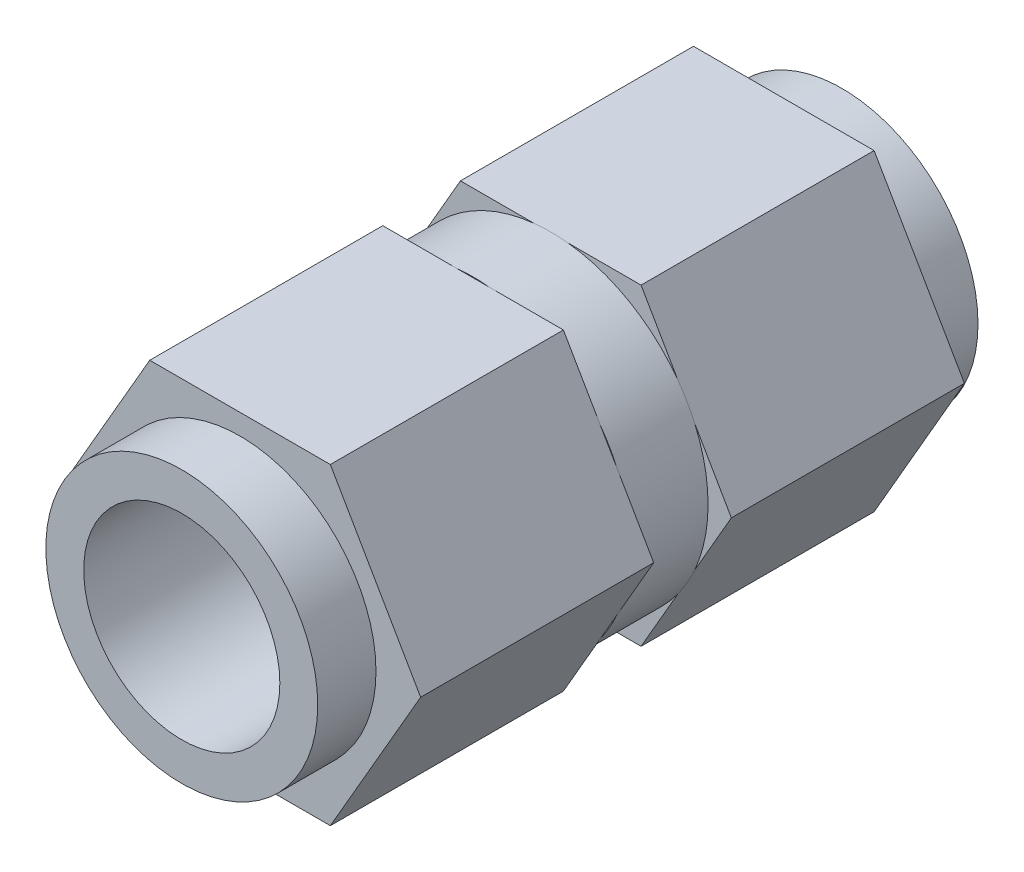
ISO-10303-21;
HEADER;
FILE_DESCRIPTION(('STEP AP214'),'2;1');
FILE_NAME('part.step','',(''),(''),'','','');
FILE_SCHEMA(('AUTOMOTIVE_DESIGN { 1 0 10303 214 1 1 1 1 }'));
ENDSEC;
DATA;
#1=APPLICATION_CONTEXT('core data for automotive mechanical design processes');
#2=APPLICATION_PROTOCOL_DEFINITION('international standard','automotive_design',2000,#1);
#3=PRODUCT_CONTEXT('',#1,'mechanical');
#4=PRODUCT('Part','Part','',(#3));
#5=PRODUCT_RELATED_PRODUCT_CATEGORY('part','',(#4));
#6=PRODUCT_DEFINITION_FORMATION('','',#4);
#7=PRODUCT_DEFINITION_CONTEXT('part definition',#1,'design');
#8=PRODUCT_DEFINITION('design','',#6,#7);
#9=PRODUCT_DEFINITION_SHAPE('','',#8);
#10=(LENGTH_UNIT() NAMED_UNIT(*) SI_UNIT(.MILLI.,.METRE.));
#11=(NAMED_UNIT(*) PLANE_ANGLE_UNIT() SI_UNIT($,.RADIAN.));
#12=(NAMED_UNIT(*) SI_UNIT($,.STERADIAN.) SOLID_ANGLE_UNIT());
#13=UNCERTAINTY_MEASURE_WITH_UNIT(LENGTH_MEASURE(1.E-05),#10,'distance_accuracy_value','');
#14=(GEOMETRIC_REPRESENTATION_CONTEXT(3) GLOBAL_UNCERTAINTY_ASSIGNED_CONTEXT((#13)) GLOBAL_UNIT_ASSIGNED_CONTEXT((#10,
#11,#12)) REPRESENTATION_CONTEXT('',''));
#15=CARTESIAN_POINT('',(0.,0.,0.));
#16=DIRECTION('',(0.,0.,1.));
#17=DIRECTION('',(1.,0.,0.));
#18=AXIS2_PLACEMENT_3D('',#15,#16,#17);
#19=CARTESIAN_POINT('',(0.,0.,1.));
#20=DIRECTION('',(0.,0.,-1.));
#21=DIRECTION('',(-1.,0.,0.));
#22=AXIS2_PLACEMENT_3D('',#19,#20,#21);
#23=CYLINDRICAL_SURFACE('',#22,0.75);
#24=CARTESIAN_POINT('',(0.,0.,-0.5));
#25=DIRECTION('',(0.,0.,-1.));
#26=DIRECTION('',(-1.,0.,0.));
#27=AXIS2_PLACEMENT_3D('',#24,#25,#26);
#28=CIRCLE('',#27,0.75);
#29=CARTESIAN_POINT('',(-0.75,0.,-0.5));
#30=VERTEX_POINT('',#29);
#31=EDGE_CURVE('E1018',#30,#30,#28,.T.);
#32=ORIENTED_EDGE('',*,*,#31,.T.);
#33=EDGE_LOOP('',(#32));
#34=FACE_BOUND('',#33,.T.);
#35=CARTESIAN_POINT('',(0.,0.,0.5));
#36=DIRECTION('',(0.,0.,1.));
#37=DIRECTION('',(1.,0.,0.));
#38=AXIS2_PLACEMENT_3D('',#35,#36,#37);
#39=CIRCLE('',#38,0.75);
#40=CARTESIAN_POINT('',(0.75,0.,0.5));
#41=VERTEX_POINT('',#40);
#42=EDGE_CURVE('E40',#41,#41,#39,.F.);
#43=ORIENTED_EDGE('',*,*,#42,.F.);
#44=EDGE_LOOP('',(#43));
#45=FACE_BOUND('',#44,.T.);
#46=ADVANCED_FACE('F36',(#34,#45),#23,.F.);
#47=CARTESIAN_POINT('',(0.,0.,14.));
#48=DIRECTION('',(0.,0.,1.));
#49=DIRECTION('',(1.,0.,0.));
#50=AXIS2_PLACEMENT_3D('',#47,#48,#49);
#51=PLANE('',#50);
#52=DIRECTION('',(0.499999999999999,0.866025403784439,0.));
#53=VECTOR('',#52,1.);
#54=CARTESIAN_POINT('',(2.325,-4.02701812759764,14.));
#55=LINE('',#54,#53);
#56=CARTESIAN_POINT('',(2.325,-4.02701812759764,14.));
#57=VERTEX_POINT('',#56);
#58=CARTESIAN_POINT('',(4.65,0.,14.));
#59=VERTEX_POINT('',#58);
#60=EDGE_CURVE('E211',#57,#59,#55,.T.);
#61=ORIENTED_EDGE('',*,*,#60,.T.);
#62=DIRECTION('',(-0.5,0.866025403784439,0.));
#63=VECTOR('',#62,1.);
#64=CARTESIAN_POINT('',(4.65,0.,14.));
#65=LINE('',#64,#63);
#66=CARTESIAN_POINT('',(2.325,4.02701812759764,14.));
#67=VERTEX_POINT('',#66);
#68=EDGE_CURVE('E199',#59,#67,#65,.T.);
#69=ORIENTED_EDGE('',*,*,#68,.T.);
#70=DIRECTION('',(-1.,0.,0.));
#71=VECTOR('',#70,1.);
#72=CARTESIAN_POINT('',(2.325,4.02701812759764,14.));
#73=LINE('',#72,#71);
#74=CARTESIAN_POINT('',(-2.325,4.02701812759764,14.));
#75=VERTEX_POINT('',#74);
#76=EDGE_CURVE('E210',#67,#75,#73,.T.);
#77=ORIENTED_EDGE('',*,*,#76,.T.);
#78=DIRECTION('',(-0.5,-0.866025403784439,0.));
#79=VECTOR('',#78,1.);
#80=CARTESIAN_POINT('',(-2.325,4.02701812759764,14.));
#81=LINE('',#80,#79);
#82=CARTESIAN_POINT('',(-4.65,0.,14.));
#83=VERTEX_POINT('',#82);
#84=EDGE_CURVE('E588',#75,#83,#81,.T.);
#85=ORIENTED_EDGE('',*,*,#84,.T.);
#86=DIRECTION('',(0.5,-0.866025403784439,0.));
#87=VECTOR('',#86,1.);
#88=CARTESIAN_POINT('',(-4.65,0.,14.));
#89=LINE('',#88,#87);
#90=CARTESIAN_POINT('',(-2.325,-4.02701812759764,14.));
#91=VERTEX_POINT('',#90);
#92=EDGE_CURVE('E1022',#83,#91,#89,.T.);
#93=ORIENTED_EDGE('',*,*,#92,.T.);
#94=DIRECTION('',(1.,0.,0.));
#95=VECTOR('',#94,1.);
#96=CARTESIAN_POINT('',(-2.325,-4.02701812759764,14.));
#97=LINE('',#96,#95);
#98=EDGE_CURVE('E217',#91,#57,#97,.T.);
#99=ORIENTED_EDGE('',*,*,#98,.T.);
#100=EDGE_LOOP('',(#61,#69,#77,#85,#93,#99));
#101=FACE_BOUND('',#100,.T.);
#102=CARTESIAN_POINT('',(0.,0.,14.));
#103=DIRECTION('',(0.,0.,1.));
#104=DIRECTION('',(1.,0.,0.));
#105=AXIS2_PLACEMENT_3D('',#102,#103,#104);
#106=CIRCLE('',#105,3.5);
#107=CARTESIAN_POINT('',(3.5,0.,14.));
#108=VERTEX_POINT('',#107);
#109=EDGE_CURVE('E1019',#108,#108,#106,.T.);
#110=ORIENTED_EDGE('',*,*,#109,.F.);
#111=EDGE_LOOP('',(#110));
#112=FACE_BOUND('',#111,.T.);
#113=ADVANCED_FACE('F214',(#101,#112),#51,.T.);
#114=CARTESIAN_POINT('',(0.,0.,0.));
#115=DIRECTION('',(0.,0.,1.));
#116=DIRECTION('',(1.,0.,0.));
#117=AXIS2_PLACEMENT_3D('',#114,#115,#116);
#118=PLANE('',#117);
#119=DIRECTION('',(0.499999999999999,0.866025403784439,0.));
#120=VECTOR('',#119,1.);
#121=CARTESIAN_POINT('',(2.325,-4.02701812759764,0.));
#122=LINE('',#121,#120);
#123=CARTESIAN_POINT('',(2.325,-4.02701812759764,0.));
#124=VERTEX_POINT('',#123);
#125=CARTESIAN_POINT('',(4.65,0.,0.));
#126=VERTEX_POINT('',#125);
#127=EDGE_CURVE('E246',#124,#126,#122,.T.);
#128=ORIENTED_EDGE('',*,*,#127,.F.);
#129=DIRECTION('',(1.,0.,0.));
#130=VECTOR('',#129,1.);
#131=CARTESIAN_POINT('',(-2.325,-4.02701812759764,0.));
#132=LINE('',#131,#130);
#133=CARTESIAN_POINT('',(-2.325,-4.02701812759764,0.));
#134=VERTEX_POINT('',#133);
#135=EDGE_CURVE('E303',#134,#124,#132,.T.);
#136=ORIENTED_EDGE('',*,*,#135,.F.);
#137=DIRECTION('',(0.5,-0.866025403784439,0.));
#138=VECTOR('',#137,1.);
#139=CARTESIAN_POINT('',(-4.65,0.,0.));
#140=LINE('',#139,#138);
#141=CARTESIAN_POINT('',(-4.65,0.,0.));
#142=VERTEX_POINT('',#141);
#143=EDGE_CURVE('E300',#142,#134,#140,.T.);
#144=ORIENTED_EDGE('',*,*,#143,.F.);
#145=DIRECTION('',(-0.5,-0.866025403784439,0.));
#146=VECTOR('',#145,1.);
#147=CARTESIAN_POINT('',(-2.325,4.02701812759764,0.));
#148=LINE('',#147,#146);
#149=CARTESIAN_POINT('',(-2.325,4.02701812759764,0.));
#150=VERTEX_POINT('',#149);
#151=EDGE_CURVE('E297',#150,#142,#148,.T.);
#152=ORIENTED_EDGE('',*,*,#151,.F.);
#153=DIRECTION('',(-1.,0.,0.));
#154=VECTOR('',#153,1.);
#155=CARTESIAN_POINT('',(2.325,4.02701812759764,0.));
#156=LINE('',#155,#154);
#157=CARTESIAN_POINT('',(2.325,4.02701812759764,0.));
#158=VERTEX_POINT('',#157);
#159=EDGE_CURVE('E294',#158,#150,#156,.T.);
#160=ORIENTED_EDGE('',*,*,#159,.F.);
#161=DIRECTION('',(-0.5,0.866025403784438,0.));
#162=VECTOR('',#161,1.);
#163=CARTESIAN_POINT('',(4.65,0.,0.));
#164=LINE('',#163,#162);
#165=EDGE_CURVE('E291',#126,#158,#164,.T.);
#166=ORIENTED_EDGE('',*,*,#165,.F.);
#167=EDGE_LOOP('',(#128,#136,#144,#152,#160,#166));
#168=FACE_BOUND('',#167,.T.);
#169=CARTESIAN_POINT('',(0.,0.,0.));
#170=DIRECTION('',(0.,0.,1.));
#171=DIRECTION('',(1.,0.,0.));
#172=AXIS2_PLACEMENT_3D('',#169,#170,#171);
#173=CIRCLE('',#172,3.5);
#174=CARTESIAN_POINT('',(3.5,0.,0.));
#175=VERTEX_POINT('',#174);
#176=EDGE_CURVE('E11',#175,#175,#173,.F.);
#177=ORIENTED_EDGE('',*,*,#176,.F.);
#178=EDGE_LOOP('',(#177));
#179=FACE_BOUND('',#178,.T.);
#180=ADVANCED_FACE('F420',(#168,#179),#118,.F.);
#181=CARTESIAN_POINT('',(0.,0.,8.));
#182=DIRECTION('',(0.,0.,1.));
#183=DIRECTION('',(1.,0.,0.));
#184=AXIS2_PLACEMENT_3D('',#181,#182,#183);
#185=PLANE('',#184);
#186=DIRECTION('',(0.499999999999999,0.866025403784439,0.));
#187=VECTOR('',#186,1.);
#188=CARTESIAN_POINT('',(2.325,-4.02701812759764,8.));
#189=LINE('',#188,#187);
#190=CARTESIAN_POINT('',(3.27207876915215,-2.38662958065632,8.));
#191=VERTEX_POINT('',#190);
#192=CARTESIAN_POINT('',(3.70292123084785,-1.64038854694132,8.));
#193=VERTEX_POINT('',#192);
#194=EDGE_CURVE('E46',#191,#193,#189,.T.);
#195=ORIENTED_EDGE('',*,*,#194,.F.);
#196=CARTESIAN_POINT('',(0.,0.,8.));
#197=DIRECTION('',(0.,0.,1.));
#198=DIRECTION('',(1.,0.,0.));
#199=AXIS2_PLACEMENT_3D('',#196,#197,#198);
#200=CIRCLE('',#199,4.050000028);
#201=EDGE_CURVE('E543',#191,#193,#200,.T.);
#202=ORIENTED_EDGE('',*,*,#201,.T.);
#203=EDGE_LOOP('',(#195,#202));
#204=FACE_BOUND('',#203,.T.);
#205=ADVANCED_FACE('F528',(#204),#185,.T.);
#206=DIRECTION('',(1.,0.,0.));
#207=VECTOR('',#206,1.);
#208=CARTESIAN_POINT('',(-2.325,-4.02701812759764,8.));
#209=LINE('',#208,#207);
#210=CARTESIAN_POINT('',(-0.430842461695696,-4.02701812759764,8.));
#211=VERTEX_POINT('',#210);
#212=CARTESIAN_POINT('',(0.430842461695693,-4.02701812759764,8.));
#213=VERTEX_POINT('',#212);
#214=EDGE_CURVE('E572',#211,#213,#209,.T.);
#215=ORIENTED_EDGE('',*,*,#214,.F.);
#216=EDGE_CURVE('E616',#211,#213,#200,.T.);
#217=ORIENTED_EDGE('',*,*,#216,.T.);
#218=EDGE_LOOP('',(#215,#217));
#219=FACE_BOUND('',#218,.T.);
#220=ADVANCED_FACE('F630',(#219),#185,.T.);
#221=DIRECTION('',(0.5,-0.866025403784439,0.));
#222=VECTOR('',#221,1.);
#223=CARTESIAN_POINT('',(-4.65,0.,8.));
#224=LINE('',#223,#222);
#225=CARTESIAN_POINT('',(-3.70292123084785,-1.64038854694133,8.));
#226=VERTEX_POINT('',#225);
#227=CARTESIAN_POINT('',(-3.27207876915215,-2.38662958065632,8.));
#228=VERTEX_POINT('',#227);
#229=EDGE_CURVE('E568',#226,#228,#224,.T.);
#230=ORIENTED_EDGE('',*,*,#229,.F.);
#231=EDGE_CURVE('E604',#226,#228,#200,.T.);
#232=ORIENTED_EDGE('',*,*,#231,.T.);
#233=EDGE_LOOP('',(#230,#232));
#234=FACE_BOUND('',#233,.T.);
#235=ADVANCED_FACE('F635',(#234),#185,.T.);
#236=DIRECTION('',(-0.5,-0.866025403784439,0.));
#237=VECTOR('',#236,1.);
#238=CARTESIAN_POINT('',(-2.325,4.02701812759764,8.));
#239=LINE('',#238,#237);
#240=CARTESIAN_POINT('',(-3.27207876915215,2.38662958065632,8.));
#241=VERTEX_POINT('',#240);
#242=CARTESIAN_POINT('',(-3.70292123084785,1.64038854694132,8.));
#243=VERTEX_POINT('',#242);
#244=EDGE_CURVE('E562',#241,#243,#239,.T.);
#245=ORIENTED_EDGE('',*,*,#244,.F.);
#246=EDGE_CURVE('E597',#241,#243,#200,.T.);
#247=ORIENTED_EDGE('',*,*,#246,.T.);
#248=EDGE_LOOP('',(#245,#247));
#249=FACE_BOUND('',#248,.T.);
#250=ADVANCED_FACE('F682',(#249),#185,.T.);
#251=DIRECTION('',(-1.,0.,0.));
#252=VECTOR('',#251,1.);
#253=CARTESIAN_POINT('',(2.325,4.02701812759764,8.));
#254=LINE('',#253,#252);
#255=CARTESIAN_POINT('',(0.430842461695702,4.02701812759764,8.));
#256=VERTEX_POINT('',#255);
#257=CARTESIAN_POINT('',(-0.430842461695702,4.02701812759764,8.));
#258=VERTEX_POINT('',#257);
#259=EDGE_CURVE('E365',#256,#258,#254,.T.);
#260=ORIENTED_EDGE('',*,*,#259,.F.);
#261=EDGE_CURVE('E596',#256,#258,#200,.T.);
#262=ORIENTED_EDGE('',*,*,#261,.T.);
#263=EDGE_LOOP('',(#260,#262));
#264=FACE_BOUND('',#263,.T.);
#265=ADVANCED_FACE('F529',(#264),#185,.T.);
#266=CARTESIAN_POINT('',(0.,0.,6.));
#267=DIRECTION('',(0.,0.,1.));
#268=DIRECTION('',(1.,0.,0.));
#269=AXIS2_PLACEMENT_3D('',#266,#267,#268);
#270=PLANE('',#269);
#271=CARTESIAN_POINT('',(0.,0.,6.));
#272=DIRECTION('',(0.,0.,1.));
#273=DIRECTION('',(1.,0.,0.));
#274=AXIS2_PLACEMENT_3D('',#271,#272,#273);
#275=CIRCLE('',#274,4.050000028);
#276=CARTESIAN_POINT('',(3.27207876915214,2.38662958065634,6.));
#277=VERTEX_POINT('',#276);
#278=CARTESIAN_POINT('',(0.430842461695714,4.02701812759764,6.));
#279=VERTEX_POINT('',#278);
#280=EDGE_CURVE('E357',#277,#279,#275,.T.);
#281=ORIENTED_EDGE('',*,*,#280,.F.);
#282=DIRECTION('',(-0.5,0.866025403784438,0.));
#283=VECTOR('',#282,1.);
#284=CARTESIAN_POINT('',(4.65,0.,6.));
#285=LINE('',#284,#283);
#286=CARTESIAN_POINT('',(2.325,4.02701812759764,6.));
#287=VERTEX_POINT('',#286);
#288=EDGE_CURVE('E256',#277,#287,#285,.T.);
#289=ORIENTED_EDGE('',*,*,#288,.T.);
#290=DIRECTION('',(-1.,0.,0.));
#291=VECTOR('',#290,1.);
#292=CARTESIAN_POINT('',(2.325,4.02701812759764,6.));
#293=LINE('',#292,#291);
#294=EDGE_CURVE('E264',#287,#279,#293,.T.);
#295=ORIENTED_EDGE('',*,*,#294,.T.);
#296=EDGE_LOOP('',(#281,#289,#295));
#297=FACE_BOUND('',#296,.T.);
#298=ADVANCED_FACE('F433',(#297),#270,.T.);
#299=CARTESIAN_POINT('',(-0.430842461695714,4.02701812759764,6.));
#300=VERTEX_POINT('',#299);
#301=CARTESIAN_POINT('',(-3.27207876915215,2.38662958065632,6.));
#302=VERTEX_POINT('',#301);
#303=EDGE_CURVE('E352',#300,#302,#275,.T.);
#304=ORIENTED_EDGE('',*,*,#303,.F.);
#305=CARTESIAN_POINT('',(-2.325,4.02701812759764,6.));
#306=VERTEX_POINT('',#305);
#307=EDGE_CURVE('E262',#300,#306,#293,.T.);
#308=ORIENTED_EDGE('',*,*,#307,.T.);
#309=DIRECTION('',(-0.5,-0.866025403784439,0.));
#310=VECTOR('',#309,1.);
#311=CARTESIAN_POINT('',(-2.325,4.02701812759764,6.));
#312=LINE('',#311,#310);
#313=EDGE_CURVE('E270',#306,#302,#312,.T.);
#314=ORIENTED_EDGE('',*,*,#313,.T.);
#315=EDGE_LOOP('',(#304,#308,#314));
#316=FACE_BOUND('',#315,.T.);
#317=ADVANCED_FACE('F439',(#316),#270,.T.);
#318=CARTESIAN_POINT('',(-3.70292123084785,1.64038854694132,6.));
#319=VERTEX_POINT('',#318);
#320=CARTESIAN_POINT('',(-3.70292123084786,-1.64038854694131,6.));
#321=VERTEX_POINT('',#320);
#322=EDGE_CURVE('E346',#319,#321,#275,.T.);
#323=ORIENTED_EDGE('',*,*,#322,.F.);
#324=CARTESIAN_POINT('',(-4.65,0.,6.));
#325=VERTEX_POINT('',#324);
#326=EDGE_CURVE('E268',#319,#325,#312,.T.);
#327=ORIENTED_EDGE('',*,*,#326,.T.);
#328=DIRECTION('',(0.5,-0.866025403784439,0.));
#329=VECTOR('',#328,1.);
#330=CARTESIAN_POINT('',(-4.65,0.,6.));
#331=LINE('',#330,#329);
#332=EDGE_CURVE('E276',#325,#321,#331,.T.);
#333=ORIENTED_EDGE('',*,*,#332,.T.);
#334=EDGE_LOOP('',(#323,#327,#333));
#335=FACE_BOUND('',#334,.T.);
#336=ADVANCED_FACE('F449',(#335),#270,.T.);
#337=CARTESIAN_POINT('',(-3.27207876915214,-2.38662958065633,6.));
#338=VERTEX_POINT('',#337);
#339=CARTESIAN_POINT('',(-0.430842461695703,-4.02701812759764,6.));
#340=VERTEX_POINT('',#339);
#341=EDGE_CURVE('E340',#338,#340,#275,.T.);
#342=ORIENTED_EDGE('',*,*,#341,.F.);
#343=CARTESIAN_POINT('',(-2.325,-4.02701812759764,6.));
#344=VERTEX_POINT('',#343);
#345=EDGE_CURVE('E274',#338,#344,#331,.T.);
#346=ORIENTED_EDGE('',*,*,#345,.T.);
#347=DIRECTION('',(1.,0.,0.));
#348=VECTOR('',#347,1.);
#349=CARTESIAN_POINT('',(-2.325,-4.02701812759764,6.));
#350=LINE('',#349,#348);
#351=EDGE_CURVE('E282',#344,#340,#350,.T.);
#352=ORIENTED_EDGE('',*,*,#351,.T.);
#353=EDGE_LOOP('',(#342,#346,#352));
#354=FACE_BOUND('',#353,.T.);
#355=ADVANCED_FACE('F460',(#354),#270,.T.);
#356=CARTESIAN_POINT('',(0.430842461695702,-4.02701812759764,6.));
#357=VERTEX_POINT('',#356);
#358=CARTESIAN_POINT('',(3.27207876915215,-2.38662958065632,6.));
#359=VERTEX_POINT('',#358);
#360=EDGE_CURVE('E334',#357,#359,#275,.T.);
#361=ORIENTED_EDGE('',*,*,#360,.F.);
#362=CARTESIAN_POINT('',(2.325,-4.02701812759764,6.));
#363=VERTEX_POINT('',#362);
#364=EDGE_CURVE('E280',#357,#363,#350,.T.);
#365=ORIENTED_EDGE('',*,*,#364,.T.);
#366=DIRECTION('',(0.499999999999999,0.866025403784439,0.));
#367=VECTOR('',#366,1.);
#368=CARTESIAN_POINT('',(2.325,-4.02701812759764,6.));
#369=LINE('',#368,#367);
#370=EDGE_CURVE('E252',#363,#359,#369,.T.);
#371=ORIENTED_EDGE('',*,*,#370,.T.);
#372=EDGE_LOOP('',(#361,#365,#371));
#373=FACE_BOUND('',#372,.T.);
#374=ADVANCED_FACE('F397',(#373),#270,.T.);
#375=CARTESIAN_POINT('',(2.325,-4.02701812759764,6.));
#376=DIRECTION('',(-0.866025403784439,0.499999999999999,0.));
#377=DIRECTION('',(-0.499999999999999,-0.866025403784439,0.));
#378=AXIS2_PLACEMENT_3D('',#375,#376,#377);
#379=PLANE('',#378);
#380=ORIENTED_EDGE('',*,*,#127,.T.);
#381=DIRECTION('',(0.,0.,-1.));
#382=VECTOR('',#381,1.);
#383=CARTESIAN_POINT('',(4.65,0.,6.));
#384=LINE('',#383,#382);
#385=CARTESIAN_POINT('',(4.65,0.,6.));
#386=VERTEX_POINT('',#385);
#387=EDGE_CURVE('E324',#386,#126,#384,.T.);
#388=ORIENTED_EDGE('',*,*,#387,.F.);
#389=CARTESIAN_POINT('',(3.70292123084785,-1.64038854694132,6.));
#390=VERTEX_POINT('',#389);
#391=EDGE_CURVE('E258',#390,#386,#369,.T.);
#392=ORIENTED_EDGE('',*,*,#391,.F.);
#393=EDGE_CURVE('E257',#359,#390,#369,.T.);
#394=ORIENTED_EDGE('',*,*,#393,.F.);
#395=ORIENTED_EDGE('',*,*,#370,.F.);
#396=DIRECTION('',(0.,0.,-1.));
#397=VECTOR('',#396,1.);
#398=CARTESIAN_POINT('',(2.325,-4.02701812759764,6.));
#399=LINE('',#398,#397);
#400=EDGE_CURVE('E286',#363,#124,#399,.T.);
#401=ORIENTED_EDGE('',*,*,#400,.T.);
#402=EDGE_LOOP('',(#380,#388,#392,#394,#395,#401));
#403=FACE_BOUND('',#402,.T.);
#404=ADVANCED_FACE('F38',(#403),#379,.F.);
#405=CARTESIAN_POINT('',(4.65,0.,6.));
#406=DIRECTION('',(-0.866025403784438,-0.5,0.));
#407=DIRECTION('',(0.5,-0.866025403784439,0.));
#408=AXIS2_PLACEMENT_3D('',#405,#406,#407);
#409=PLANE('',#408);
#410=ORIENTED_EDGE('',*,*,#165,.T.);
#411=DIRECTION('',(0.,0.,-1.));
#412=VECTOR('',#411,1.);
#413=CARTESIAN_POINT('',(2.325,4.02701812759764,6.));
#414=LINE('',#413,#412);
#415=EDGE_CURVE('E320',#287,#158,#414,.T.);
#416=ORIENTED_EDGE('',*,*,#415,.F.);
#417=ORIENTED_EDGE('',*,*,#288,.F.);
#418=CARTESIAN_POINT('',(3.70292123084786,1.6403885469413,6.));
#419=VERTEX_POINT('',#418);
#420=EDGE_CURVE('E263',#419,#277,#285,.T.);
#421=ORIENTED_EDGE('',*,*,#420,.F.);
#422=EDGE_CURVE('E259',#386,#419,#285,.T.);
#423=ORIENTED_EDGE('',*,*,#422,.F.);
#424=ORIENTED_EDGE('',*,*,#387,.T.);
#425=EDGE_LOOP('',(#410,#416,#417,#421,#423,#424));
#426=FACE_BOUND('',#425,.T.);
#427=ADVANCED_FACE('F416',(#426),#409,.F.);
#428=CARTESIAN_POINT('',(2.325,4.02701812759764,6.));
#429=DIRECTION('',(0.,-1.,0.));
#430=DIRECTION('',(0.,0.,-1.));
#431=AXIS2_PLACEMENT_3D('',#428,#429,#430);
#432=PLANE('',#431);
#433=ORIENTED_EDGE('',*,*,#159,.T.);
#434=DIRECTION('',(0.,0.,-1.));
#435=VECTOR('',#434,1.);
#436=CARTESIAN_POINT('',(-2.325,4.02701812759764,6.));
#437=LINE('',#436,#435);
#438=EDGE_CURVE('E316',#306,#150,#437,.T.);
#439=ORIENTED_EDGE('',*,*,#438,.F.);
#440=ORIENTED_EDGE('',*,*,#307,.F.);
#441=EDGE_CURVE('E269',#279,#300,#293,.T.);
#442=ORIENTED_EDGE('',*,*,#441,.F.);
#443=ORIENTED_EDGE('',*,*,#294,.F.);
#444=ORIENTED_EDGE('',*,*,#415,.T.);
#445=EDGE_LOOP('',(#433,#439,#440,#442,#443,#444));
#446=FACE_BOUND('',#445,.T.);
#447=ADVANCED_FACE('F428',(#446),#432,.F.);
#448=CARTESIAN_POINT('',(-2.325,4.02701812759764,6.));
#449=DIRECTION('',(0.866025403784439,-0.5,0.));
#450=DIRECTION('',(0.5,0.866025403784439,0.));
#451=AXIS2_PLACEMENT_3D('',#448,#449,#450);
#452=PLANE('',#451);
#453=ORIENTED_EDGE('',*,*,#151,.T.);
#454=DIRECTION('',(0.,0.,-1.));
#455=VECTOR('',#454,1.);
#456=CARTESIAN_POINT('',(-4.65,0.,6.));
#457=LINE('',#456,#455);
#458=EDGE_CURVE('E312',#325,#142,#457,.T.);
#459=ORIENTED_EDGE('',*,*,#458,.F.);
#460=ORIENTED_EDGE('',*,*,#326,.F.);
#461=EDGE_CURVE('E275',#302,#319,#312,.T.);
#462=ORIENTED_EDGE('',*,*,#461,.F.);
#463=ORIENTED_EDGE('',*,*,#313,.F.);
#464=ORIENTED_EDGE('',*,*,#438,.T.);
#465=EDGE_LOOP('',(#453,#459,#460,#462,#463,#464));
#466=FACE_BOUND('',#465,.T.);
#467=ADVANCED_FACE('F442',(#466),#452,.F.);
#468=CARTESIAN_POINT('',(-4.65,0.,6.));
#469=DIRECTION('',(0.866025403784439,0.5,0.));
#470=DIRECTION('',(-0.5,0.866025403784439,0.));
#471=AXIS2_PLACEMENT_3D('',#468,#469,#470);
#472=PLANE('',#471);
#473=ORIENTED_EDGE('',*,*,#143,.T.);
#474=DIRECTION('',(0.,0.,-1.));
#475=VECTOR('',#474,1.);
#476=CARTESIAN_POINT('',(-2.325,-4.02701812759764,6.));
#477=LINE('',#476,#475);
#478=EDGE_CURVE('E308',#344,#134,#477,.T.);
#479=ORIENTED_EDGE('',*,*,#478,.F.);
#480=ORIENTED_EDGE('',*,*,#345,.F.);
#481=EDGE_CURVE('E281',#321,#338,#331,.T.);
#482=ORIENTED_EDGE('',*,*,#481,.F.);
#483=ORIENTED_EDGE('',*,*,#332,.F.);
#484=ORIENTED_EDGE('',*,*,#458,.T.);
#485=EDGE_LOOP('',(#473,#479,#480,#482,#483,#484));
#486=FACE_BOUND('',#485,.T.);
#487=ADVANCED_FACE('F452',(#486),#472,.F.);
#488=CARTESIAN_POINT('',(-2.325,-4.02701812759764,6.));
#489=DIRECTION('',(0.,1.,0.));
#490=DIRECTION('',(-1.,0.,0.));
#491=AXIS2_PLACEMENT_3D('',#488,#489,#490);
#492=PLANE('',#491);
#493=ORIENTED_EDGE('',*,*,#135,.T.);
#494=ORIENTED_EDGE('',*,*,#400,.F.);
#495=ORIENTED_EDGE('',*,*,#364,.F.);
#496=EDGE_CURVE('E287',#340,#357,#350,.T.);
#497=ORIENTED_EDGE('',*,*,#496,.F.);
#498=ORIENTED_EDGE('',*,*,#351,.F.);
#499=ORIENTED_EDGE('',*,*,#478,.T.);
#500=EDGE_LOOP('',(#493,#494,#495,#497,#498,#499));
#501=FACE_BOUND('',#500,.T.);
#502=ADVANCED_FACE('F400',(#501),#492,.F.);
#503=EDGE_CURVE('E251',#390,#419,#275,.T.);
#504=ORIENTED_EDGE('',*,*,#503,.F.);
#505=ORIENTED_EDGE('',*,*,#391,.T.);
#506=ORIENTED_EDGE('',*,*,#422,.T.);
#507=EDGE_LOOP('',(#504,#505,#506));
#508=FACE_BOUND('',#507,.T.);
#509=ADVANCED_FACE('F414',(#508),#270,.T.);
#510=CARTESIAN_POINT('',(0.,0.,6.));
#511=DIRECTION('',(0.,0.,1.));
#512=DIRECTION('',(1.,0.,0.));
#513=AXIS2_PLACEMENT_3D('',#510,#511,#512);
#514=PLANE('',#513);
#515=EDGE_CURVE('E230',#359,#390,#275,.T.);
#516=ORIENTED_EDGE('',*,*,#515,.F.);
#517=ORIENTED_EDGE('',*,*,#393,.T.);
#518=EDGE_LOOP('',(#516,#517));
#519=FACE_BOUND('',#518,.T.);
#520=ADVANCED_FACE('F530',(#519),#514,.F.);
#521=EDGE_CURVE('E238',#419,#277,#275,.T.);
#522=ORIENTED_EDGE('',*,*,#521,.F.);
#523=ORIENTED_EDGE('',*,*,#420,.T.);
#524=EDGE_LOOP('',(#522,#523));
#525=FACE_BOUND('',#524,.T.);
#526=ADVANCED_FACE('F532',(#525),#514,.F.);
#527=EDGE_CURVE('E250',#279,#300,#275,.T.);
#528=ORIENTED_EDGE('',*,*,#527,.F.);
#529=ORIENTED_EDGE('',*,*,#441,.T.);
#530=EDGE_LOOP('',(#528,#529));
#531=FACE_BOUND('',#530,.T.);
#532=ADVANCED_FACE('F435',(#531),#514,.F.);
#533=EDGE_CURVE('E370',#302,#319,#275,.T.);
#534=ORIENTED_EDGE('',*,*,#533,.F.);
#535=ORIENTED_EDGE('',*,*,#461,.T.);
#536=EDGE_LOOP('',(#534,#535));
#537=FACE_BOUND('',#536,.T.);
#538=ADVANCED_FACE('F831',(#537),#514,.F.);
#539=EDGE_CURVE('E374',#321,#338,#275,.T.);
#540=ORIENTED_EDGE('',*,*,#539,.F.);
#541=ORIENTED_EDGE('',*,*,#481,.T.);
#542=EDGE_LOOP('',(#540,#541));
#543=FACE_BOUND('',#542,.T.);
#544=ADVANCED_FACE('F537',(#543),#514,.F.);
#545=EDGE_CURVE('E236',#340,#357,#275,.T.);
#546=ORIENTED_EDGE('',*,*,#545,.F.);
#547=ORIENTED_EDGE('',*,*,#496,.T.);
#548=EDGE_LOOP('',(#546,#547));
#549=FACE_BOUND('',#548,.T.);
#550=ADVANCED_FACE('F386',(#549),#514,.F.);
#551=CARTESIAN_POINT('',(0.,0.,8.));
#552=DIRECTION('',(0.,0.,-1.));
#553=DIRECTION('',(-1.,0.,0.));
#554=AXIS2_PLACEMENT_3D('',#551,#552,#553);
#555=CYLINDRICAL_SURFACE('',#554,4.050000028);
#556=CARTESIAN_POINT('',(3.70292123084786,1.6403885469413,8.));
#557=VERTEX_POINT('',#556);
#558=CARTESIAN_POINT('',(3.27207876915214,2.38662958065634,8.));
#559=VERTEX_POINT('',#558);
#560=EDGE_CURVE('E244',#557,#559,#200,.T.);
#561=ORIENTED_EDGE('',*,*,#560,.F.);
#562=EDGE_CURVE('E53',#193,#557,#200,.T.);
#563=ORIENTED_EDGE('',*,*,#562,.F.);
#564=ORIENTED_EDGE('',*,*,#201,.F.);
#565=EDGE_CURVE('E621',#213,#191,#200,.T.);
#566=ORIENTED_EDGE('',*,*,#565,.F.);
#567=ORIENTED_EDGE('',*,*,#216,.F.);
#568=EDGE_CURVE('E610',#228,#211,#200,.T.);
#569=ORIENTED_EDGE('',*,*,#568,.F.);
#570=ORIENTED_EDGE('',*,*,#231,.F.);
#571=EDGE_CURVE('E600',#243,#226,#200,.T.);
#572=ORIENTED_EDGE('',*,*,#571,.F.);
#573=ORIENTED_EDGE('',*,*,#246,.F.);
#574=EDGE_CURVE('E593',#258,#241,#200,.T.);
#575=ORIENTED_EDGE('',*,*,#574,.F.);
#576=ORIENTED_EDGE('',*,*,#261,.F.);
#577=EDGE_CURVE('E247',#559,#256,#200,.T.);
#578=ORIENTED_EDGE('',*,*,#577,.F.);
#579=EDGE_LOOP('',(#561,#563,#564,#566,#567,#569,#570,#572,#573,#575,#576,#578));
#580=FACE_BOUND('',#579,.T.);
#581=ORIENTED_EDGE('',*,*,#521,.T.);
#582=ORIENTED_EDGE('',*,*,#280,.T.);
#583=ORIENTED_EDGE('',*,*,#527,.T.);
#584=ORIENTED_EDGE('',*,*,#303,.T.);
#585=ORIENTED_EDGE('',*,*,#533,.T.);
#586=ORIENTED_EDGE('',*,*,#322,.T.);
#587=ORIENTED_EDGE('',*,*,#539,.T.);
#588=ORIENTED_EDGE('',*,*,#341,.T.);
#589=ORIENTED_EDGE('',*,*,#545,.T.);
#590=ORIENTED_EDGE('',*,*,#360,.T.);
#591=ORIENTED_EDGE('',*,*,#515,.T.);
#592=ORIENTED_EDGE('',*,*,#503,.T.);
#593=EDGE_LOOP('',(#581,#582,#583,#584,#585,#586,#587,#588,#589,#590,#591,#592));
#594=FACE_BOUND('',#593,.T.);
#595=ADVANCED_FACE('F383',(#580,#594),#555,.T.);
#596=DIRECTION('',(-0.5,0.866025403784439,0.));
#597=VECTOR('',#596,1.);
#598=CARTESIAN_POINT('',(4.65,0.,8.));
#599=LINE('',#598,#597);
#600=EDGE_CURVE('E361',#557,#559,#599,.T.);
#601=ORIENTED_EDGE('',*,*,#600,.F.);
#602=ORIENTED_EDGE('',*,*,#560,.T.);
#603=EDGE_LOOP('',(#601,#602));
#604=FACE_BOUND('',#603,.T.);
#605=ADVANCED_FACE('F503',(#604),#185,.T.);
#606=CARTESIAN_POINT('',(0.,0.,8.));
#607=DIRECTION('',(0.,0.,1.));
#608=DIRECTION('',(1.,0.,0.));
#609=AXIS2_PLACEMENT_3D('',#606,#607,#608);
#610=PLANE('',#609);
#611=CARTESIAN_POINT('',(2.325,4.02701812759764,8.));
#612=VERTEX_POINT('',#611);
#613=EDGE_CURVE('E368',#559,#612,#599,.T.);
#614=ORIENTED_EDGE('',*,*,#613,.F.);
#615=ORIENTED_EDGE('',*,*,#577,.T.);
#616=EDGE_CURVE('E547',#612,#256,#254,.T.);
#617=ORIENTED_EDGE('',*,*,#616,.F.);
#618=EDGE_LOOP('',(#614,#615,#617));
#619=FACE_BOUND('',#618,.T.);
#620=ADVANCED_FACE('F499',(#619),#610,.F.);
#621=CARTESIAN_POINT('',(-2.325,4.02701812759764,8.));
#622=VERTEX_POINT('',#621);
#623=EDGE_CURVE('E545',#258,#622,#254,.T.);
#624=ORIENTED_EDGE('',*,*,#623,.F.);
#625=ORIENTED_EDGE('',*,*,#574,.T.);
#626=EDGE_CURVE('E557',#622,#241,#239,.T.);
#627=ORIENTED_EDGE('',*,*,#626,.F.);
#628=EDGE_LOOP('',(#624,#625,#627));
#629=FACE_BOUND('',#628,.T.);
#630=ADVANCED_FACE('F502',(#629),#610,.F.);
#631=CARTESIAN_POINT('',(-4.65,0.,8.));
#632=VERTEX_POINT('',#631);
#633=EDGE_CURVE('E556',#243,#632,#239,.T.);
#634=ORIENTED_EDGE('',*,*,#633,.F.);
#635=ORIENTED_EDGE('',*,*,#571,.T.);
#636=EDGE_CURVE('E563',#632,#226,#224,.T.);
#637=ORIENTED_EDGE('',*,*,#636,.F.);
#638=EDGE_LOOP('',(#634,#635,#637));
#639=FACE_BOUND('',#638,.T.);
#640=ADVANCED_FACE('F804',(#639),#610,.F.);
#641=CARTESIAN_POINT('',(-2.325,-4.02701812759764,8.));
#642=VERTEX_POINT('',#641);
#643=EDGE_CURVE('E561',#228,#642,#224,.T.);
#644=ORIENTED_EDGE('',*,*,#643,.F.);
#645=ORIENTED_EDGE('',*,*,#568,.T.);
#646=EDGE_CURVE('E222',#642,#211,#209,.T.);
#647=ORIENTED_EDGE('',*,*,#646,.F.);
#648=EDGE_LOOP('',(#644,#645,#647));
#649=FACE_BOUND('',#648,.T.);
#650=ADVANCED_FACE('F799',(#649),#610,.F.);
#651=CARTESIAN_POINT('',(2.325,-4.02701812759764,8.));
#652=VERTEX_POINT('',#651);
#653=EDGE_CURVE('E567',#213,#652,#209,.T.);
#654=ORIENTED_EDGE('',*,*,#653,.F.);
#655=ORIENTED_EDGE('',*,*,#565,.T.);
#656=EDGE_CURVE('E550',#652,#191,#189,.T.);
#657=ORIENTED_EDGE('',*,*,#656,.F.);
#658=EDGE_LOOP('',(#654,#655,#657));
#659=FACE_BOUND('',#658,.T.);
#660=ADVANCED_FACE('F794',(#659),#610,.F.);
#661=CARTESIAN_POINT('',(4.65,0.,8.));
#662=VERTEX_POINT('',#661);
#663=EDGE_CURVE('E227',#193,#662,#189,.T.);
#664=ORIENTED_EDGE('',*,*,#663,.F.);
#665=ORIENTED_EDGE('',*,*,#562,.T.);
#666=EDGE_CURVE('E367',#662,#557,#599,.T.);
#667=ORIENTED_EDGE('',*,*,#666,.F.);
#668=EDGE_LOOP('',(#664,#665,#667));
#669=FACE_BOUND('',#668,.T.);
#670=ADVANCED_FACE('F505',(#669),#610,.F.);
#671=CARTESIAN_POINT('',(2.325,-4.02701812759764,14.));
#672=DIRECTION('',(-0.866025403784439,0.499999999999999,0.));
#673=DIRECTION('',(-0.499999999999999,-0.866025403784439,0.));
#674=AXIS2_PLACEMENT_3D('',#671,#672,#673);
#675=PLANE('',#674);
#676=ORIENTED_EDGE('',*,*,#656,.T.);
#677=ORIENTED_EDGE('',*,*,#194,.T.);
#678=ORIENTED_EDGE('',*,*,#663,.T.);
#679=DIRECTION('',(0.,0.,-1.));
#680=VECTOR('',#679,1.);
#681=CARTESIAN_POINT('',(4.65,0.,14.));
#682=LINE('',#681,#680);
#683=EDGE_CURVE('E204',#59,#662,#682,.T.);
#684=ORIENTED_EDGE('',*,*,#683,.F.);
#685=ORIENTED_EDGE('',*,*,#60,.F.);
#686=DIRECTION('',(0.,0.,-1.));
#687=VECTOR('',#686,1.);
#688=CARTESIAN_POINT('',(2.325,-4.02701812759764,14.));
#689=LINE('',#688,#687);
#690=EDGE_CURVE('E573',#57,#652,#689,.T.);
#691=ORIENTED_EDGE('',*,*,#690,.T.);
#692=EDGE_LOOP('',(#676,#677,#678,#684,#685,#691));
#693=FACE_BOUND('',#692,.T.);
#694=ADVANCED_FACE('F225',(#693),#675,.F.);
#695=CARTESIAN_POINT('',(4.65,0.,14.));
#696=DIRECTION('',(-0.866025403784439,-0.5,0.));
#697=DIRECTION('',(0.5,-0.866025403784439,0.));
#698=AXIS2_PLACEMENT_3D('',#695,#696,#697);
#699=PLANE('',#698);
#700=ORIENTED_EDGE('',*,*,#666,.T.);
#701=ORIENTED_EDGE('',*,*,#600,.T.);
#702=ORIENTED_EDGE('',*,*,#613,.T.);
#703=DIRECTION('',(0.,0.,-1.));
#704=VECTOR('',#703,1.);
#705=CARTESIAN_POINT('',(2.325,4.02701812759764,14.));
#706=LINE('',#705,#704);
#707=EDGE_CURVE('E206',#67,#612,#706,.T.);
#708=ORIENTED_EDGE('',*,*,#707,.F.);
#709=ORIENTED_EDGE('',*,*,#68,.F.);
#710=ORIENTED_EDGE('',*,*,#683,.T.);
#711=EDGE_LOOP('',(#700,#701,#702,#708,#709,#710));
#712=FACE_BOUND('',#711,.T.);
#713=ADVANCED_FACE('F202',(#712),#699,.F.);
#714=CARTESIAN_POINT('',(2.325,4.02701812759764,14.));
#715=DIRECTION('',(0.,-1.,0.));
#716=DIRECTION('',(0.,0.,-1.));
#717=AXIS2_PLACEMENT_3D('',#714,#715,#716);
#718=PLANE('',#717);
#719=ORIENTED_EDGE('',*,*,#616,.T.);
#720=ORIENTED_EDGE('',*,*,#259,.T.);
#721=ORIENTED_EDGE('',*,*,#623,.T.);
#722=DIRECTION('',(0.,0.,-1.));
#723=VECTOR('',#722,1.);
#724=CARTESIAN_POINT('',(-2.325,4.02701812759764,14.));
#725=LINE('',#724,#723);
#726=EDGE_CURVE('E240',#75,#622,#725,.T.);
#727=ORIENTED_EDGE('',*,*,#726,.F.);
#728=ORIENTED_EDGE('',*,*,#76,.F.);
#729=ORIENTED_EDGE('',*,*,#707,.T.);
#730=EDGE_LOOP('',(#719,#720,#721,#727,#728,#729));
#731=FACE_BOUND('',#730,.T.);
#732=ADVANCED_FACE('F516',(#731),#718,.F.);
#733=CARTESIAN_POINT('',(-2.325,4.02701812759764,14.));
#734=DIRECTION('',(0.866025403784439,-0.5,0.));
#735=DIRECTION('',(0.5,0.866025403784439,0.));
#736=AXIS2_PLACEMENT_3D('',#733,#734,#735);
#737=PLANE('',#736);
#738=ORIENTED_EDGE('',*,*,#626,.T.);
#739=ORIENTED_EDGE('',*,*,#244,.T.);
#740=ORIENTED_EDGE('',*,*,#633,.T.);
#741=DIRECTION('',(0.,0.,-1.));
#742=VECTOR('',#741,1.);
#743=CARTESIAN_POINT('',(-4.65,0.,14.));
#744=LINE('',#743,#742);
#745=EDGE_CURVE('E579',#83,#632,#744,.T.);
#746=ORIENTED_EDGE('',*,*,#745,.F.);
#747=ORIENTED_EDGE('',*,*,#84,.F.);
#748=ORIENTED_EDGE('',*,*,#726,.T.);
#749=EDGE_LOOP('',(#738,#739,#740,#746,#747,#748));
#750=FACE_BOUND('',#749,.T.);
#751=ADVANCED_FACE('F512',(#750),#737,.F.);
#752=CARTESIAN_POINT('',(-4.65,0.,14.));
#753=DIRECTION('',(0.866025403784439,0.5,0.));
#754=DIRECTION('',(-0.5,0.866025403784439,0.));
#755=AXIS2_PLACEMENT_3D('',#752,#753,#754);
#756=PLANE('',#755);
#757=ORIENTED_EDGE('',*,*,#636,.T.);
#758=ORIENTED_EDGE('',*,*,#229,.T.);
#759=ORIENTED_EDGE('',*,*,#643,.T.);
#760=DIRECTION('',(0.,0.,-1.));
#761=VECTOR('',#760,1.);
#762=CARTESIAN_POINT('',(-2.325,-4.02701812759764,14.));
#763=LINE('',#762,#761);
#764=EDGE_CURVE('E575',#91,#642,#763,.T.);
#765=ORIENTED_EDGE('',*,*,#764,.F.);
#766=ORIENTED_EDGE('',*,*,#92,.F.);
#767=ORIENTED_EDGE('',*,*,#745,.T.);
#768=EDGE_LOOP('',(#757,#758,#759,#765,#766,#767));
#769=FACE_BOUND('',#768,.T.);
#770=ADVANCED_FACE('F508',(#769),#756,.F.);
#771=CARTESIAN_POINT('',(-2.325,-4.02701812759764,14.));
#772=DIRECTION('',(0.,1.,0.));
#773=DIRECTION('',(-1.,0.,0.));
#774=AXIS2_PLACEMENT_3D('',#771,#772,#773);
#775=PLANE('',#774);
#776=ORIENTED_EDGE('',*,*,#646,.T.);
#777=ORIENTED_EDGE('',*,*,#214,.T.);
#778=ORIENTED_EDGE('',*,*,#653,.T.);
#779=ORIENTED_EDGE('',*,*,#690,.F.);
#780=ORIENTED_EDGE('',*,*,#98,.F.);
#781=ORIENTED_EDGE('',*,*,#764,.T.);
#782=EDGE_LOOP('',(#776,#777,#778,#779,#780,#781));
#783=FACE_BOUND('',#782,.T.);
#784=ADVANCED_FACE('F496',(#783),#775,.F.);
#785=CARTESIAN_POINT('',(0.,0.,-1.5));
#786=DIRECTION('',(0.,0.,1.));
#787=DIRECTION('',(1.,0.,0.));
#788=AXIS2_PLACEMENT_3D('',#785,#786,#787);
#789=CYLINDRICAL_SURFACE('',#788,3.5);
#790=CARTESIAN_POINT('',(0.,0.,-1.5));
#791=DIRECTION('',(0.,0.,-1.));
#792=DIRECTION('',(-1.,0.,0.));
#793=AXIS2_PLACEMENT_3D('',#790,#791,#792);
#794=CIRCLE('',#793,3.5);
#795=CARTESIAN_POINT('',(-3.5,0.,-1.5));
#796=VERTEX_POINT('',#795);
#797=EDGE_CURVE('E1026',#796,#796,#794,.T.);
#798=ORIENTED_EDGE('',*,*,#797,.F.);
#799=EDGE_LOOP('',(#798));
#800=FACE_BOUND('',#799,.T.);
#801=ORIENTED_EDGE('',*,*,#176,.T.);
#802=EDGE_LOOP('',(#801));
#803=FACE_BOUND('',#802,.T.);
#804=ADVANCED_FACE('F493',(#800,#803),#789,.T.);
#805=CARTESIAN_POINT('',(0.,0.,-1.5));
#806=DIRECTION('',(0.,0.,-1.));
#807=DIRECTION('',(-1.,0.,0.));
#808=AXIS2_PLACEMENT_3D('',#805,#806,#807);
#809=PLANE('',#808);
#810=CARTESIAN_POINT('',(0.,0.,-1.5));
#811=DIRECTION('',(0.,0.,-1.));
#812=DIRECTION('',(-1.,0.,0.));
#813=AXIS2_PLACEMENT_3D('',#810,#811,#812);
#814=CIRCLE('',#813,2.);
#815=CARTESIAN_POINT('',(-2.,0.,-1.5));
#816=VERTEX_POINT('',#815);
#817=EDGE_CURVE('E1046',#816,#816,#814,.T.);
#818=ORIENTED_EDGE('',*,*,#817,.F.);
#819=EDGE_LOOP('',(#818));
#820=FACE_BOUND('',#819,.T.);
#821=ORIENTED_EDGE('',*,*,#797,.T.);
#822=EDGE_LOOP('',(#821));
#823=FACE_BOUND('',#822,.T.);
#824=ADVANCED_FACE('F489',(#820,#823),#809,.T.);
#825=CARTESIAN_POINT('',(0.,0.,-0.5));
#826=DIRECTION('',(0.,0.,-1.));
#827=DIRECTION('',(-1.,0.,0.));
#828=AXIS2_PLACEMENT_3D('',#825,#826,#827);
#829=CYLINDRICAL_SURFACE('',#828,2.);
#830=CARTESIAN_POINT('',(0.,0.,-0.5));
#831=DIRECTION('',(0.,0.,-1.));
#832=DIRECTION('',(-1.,0.,0.));
#833=AXIS2_PLACEMENT_3D('',#830,#831,#832);
#834=CIRCLE('',#833,2.);
#835=CARTESIAN_POINT('',(-2.,0.,-0.5));
#836=VERTEX_POINT('',#835);
#837=EDGE_CURVE('E1047',#836,#836,#834,.T.);
#838=ORIENTED_EDGE('',*,*,#837,.F.);
#839=EDGE_LOOP('',(#838));
#840=FACE_BOUND('',#839,.T.);
#841=ORIENTED_EDGE('',*,*,#817,.T.);
#842=EDGE_LOOP('',(#841));
#843=FACE_BOUND('',#842,.T.);
#844=ADVANCED_FACE('F485',(#840,#843),#829,.F.);
#845=CARTESIAN_POINT('',(0.,0.,-0.5));
#846=DIRECTION('',(0.,0.,-1.));
#847=DIRECTION('',(-1.,0.,0.));
#848=AXIS2_PLACEMENT_3D('',#845,#846,#847);
#849=PLANE('',#848);
#850=ORIENTED_EDGE('',*,*,#31,.F.);
#851=EDGE_LOOP('',(#850));
#852=FACE_BOUND('',#851,.T.);
#853=ORIENTED_EDGE('',*,*,#837,.T.);
#854=EDGE_LOOP('',(#853));
#855=FACE_BOUND('',#854,.T.);
#856=ADVANCED_FACE('F482',(#852,#855),#849,.T.);
#857=CARTESIAN_POINT('',(0.,0.,15.5));
#858=DIRECTION('',(0.,0.,-1.));
#859=DIRECTION('',(-1.,0.,0.));
#860=AXIS2_PLACEMENT_3D('',#857,#858,#859);
#861=CYLINDRICAL_SURFACE('',#860,3.5);
#862=CARTESIAN_POINT('',(0.,0.,15.5));
#863=DIRECTION('',(0.,0.,1.));
#864=DIRECTION('',(1.,0.,0.));
#865=AXIS2_PLACEMENT_3D('',#862,#863,#864);
#866=CIRCLE('',#865,3.5);
#867=CARTESIAN_POINT('',(3.5,0.,15.5));
#868=VERTEX_POINT('',#867);
#869=EDGE_CURVE('E1015',#868,#868,#866,.T.);
#870=ORIENTED_EDGE('',*,*,#869,.F.);
#871=EDGE_LOOP('',(#870));
#872=FACE_BOUND('',#871,.T.);
#873=ORIENTED_EDGE('',*,*,#109,.T.);
#874=EDGE_LOOP('',(#873));
#875=FACE_BOUND('',#874,.T.);
#876=ADVANCED_FACE('F480',(#872,#875),#861,.T.);
#877=CARTESIAN_POINT('',(0.,0.,15.5));
#878=DIRECTION('',(0.,0.,1.));
#879=DIRECTION('',(1.,0.,0.));
#880=AXIS2_PLACEMENT_3D('',#877,#878,#879);
#881=PLANE('',#880);
#882=CARTESIAN_POINT('',(0.,0.,15.5));
#883=DIRECTION('',(0.,0.,1.));
#884=DIRECTION('',(1.,0.,0.));
#885=AXIS2_PLACEMENT_3D('',#882,#883,#884);
#886=CIRCLE('',#885,2.525);
#887=CARTESIAN_POINT('',(2.525,0.,15.5));
#888=VERTEX_POINT('',#887);
#889=EDGE_CURVE('E1033',#888,#888,#886,.T.);
#890=ORIENTED_EDGE('',*,*,#889,.F.);
#891=EDGE_LOOP('',(#890));
#892=FACE_BOUND('',#891,.T.);
#893=ORIENTED_EDGE('',*,*,#869,.T.);
#894=EDGE_LOOP('',(#893));
#895=FACE_BOUND('',#894,.T.);
#896=ADVANCED_FACE('F731',(#892,#895),#881,.T.);
#897=CARTESIAN_POINT('',(0.,0.,0.5));
#898=DIRECTION('',(0.,0.,1.));
#899=DIRECTION('',(1.,0.,0.));
#900=AXIS2_PLACEMENT_3D('',#897,#898,#899);
#901=PLANE('',#900);
#902=CARTESIAN_POINT('',(0.,0.,0.5));
#903=DIRECTION('',(0.,0.,1.));
#904=DIRECTION('',(1.,0.,0.));
#905=AXIS2_PLACEMENT_3D('',#902,#903,#904);
#906=CIRCLE('',#905,2.525);
#907=CARTESIAN_POINT('',(2.525,0.,0.5));
#908=VERTEX_POINT('',#907);
#909=EDGE_CURVE('E1031',#908,#908,#906,.T.);
#910=ORIENTED_EDGE('',*,*,#909,.T.);
#911=EDGE_LOOP('',(#910));
#912=FACE_BOUND('',#911,.T.);
#913=ORIENTED_EDGE('',*,*,#42,.T.);
#914=EDGE_LOOP('',(#913));
#915=FACE_BOUND('',#914,.T.);
#916=ADVANCED_FACE('F736',(#912,#915),#901,.T.);
#917=CARTESIAN_POINT('',(0.,0.,0.5));
#918=DIRECTION('',(0.,0.,1.));
#919=DIRECTION('',(1.,0.,0.));
#920=AXIS2_PLACEMENT_3D('',#917,#918,#919);
#921=CYLINDRICAL_SURFACE('',#920,2.525);
#922=ORIENTED_EDGE('',*,*,#909,.F.);
#923=EDGE_LOOP('',(#922));
#924=FACE_BOUND('',#923,.T.);
#925=ORIENTED_EDGE('',*,*,#889,.T.);
#926=EDGE_LOOP('',(#925));
#927=FACE_BOUND('',#926,.T.);
#928=ADVANCED_FACE('F744',(#924,#927),#921,.F.);
#929=CLOSED_SHELL('',(#46,#113,#180,#205,#220,#235,#250,#265,#298,#317,#336,#355,#374,#404,#427,
#447,#467,#487,#502,#509,#520,#526,#532,#538,#544,#550,#595,#605,#620,#630,#640,#650,#660,#670,
#694,#713,#732,#751,#770,#784,#804,#824,#844,#856,#876,#896,#916,#928));
#930=MANIFOLD_SOLID_BREP('B2',#929);
#931=ADVANCED_BREP_SHAPE_REPRESENTATION('',(#18,#930),#14);
#932=SHAPE_DEFINITION_REPRESENTATION(#9,#931);
ENDSEC;
END-ISO-10303-21;
